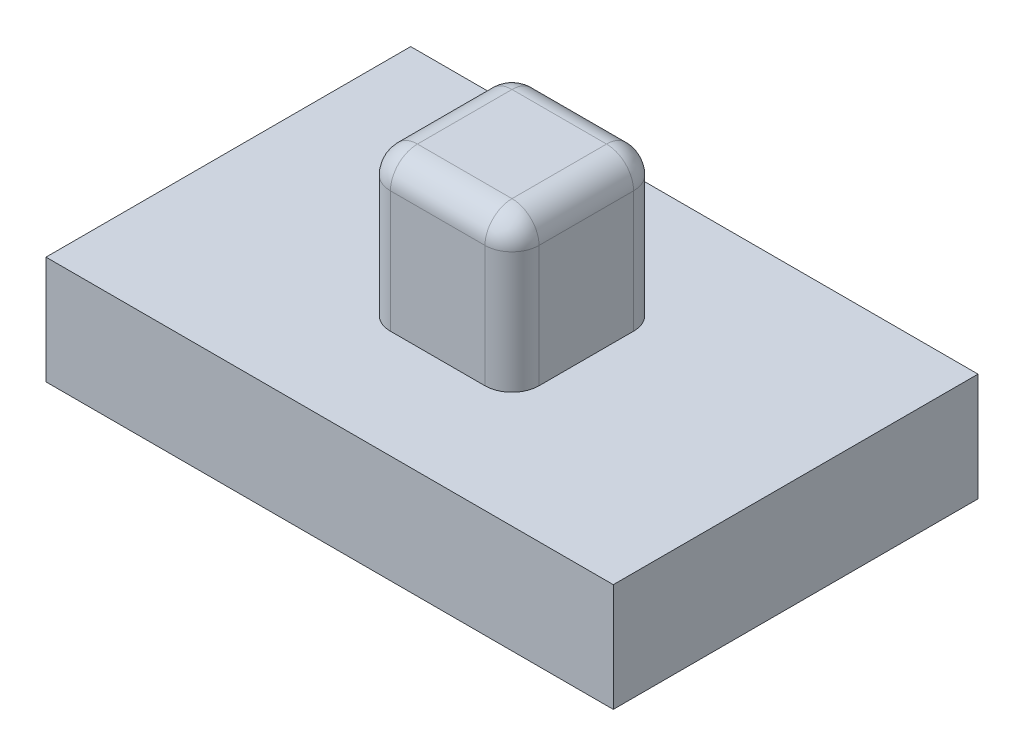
from build123d import *

# Parameters (mm, degrees)
SKETCH1_W           = 42
SKETCH1_H           = 27
BOSS_EXTRUDE1_DEPTH = 8
SKETCH2_W           = 11
SKETCH2_H           = 11
BOSS_EXTRUDE2_DEPTH = 11
FILLET1_R           = 2


with BuildPart() as part:
    # Sketch1 → Boss-Extrude1 (new body)
    with BuildSketch(Plane(origin=(0, 0, 0), x_dir=(1, 0, 0), z_dir=(0, 1, 0))):
        Rectangle(SKETCH1_W, SKETCH1_H)
    extrude(amount=BOSS_EXTRUDE1_DEPTH)

    # Sketch2 → Boss-Extrude2 (add)
    with BuildSketch(Plane(origin=(0, 8, 0), x_dir=(1, 0, 0), z_dir=(0, 1, 0))):
        Rectangle(SKETCH2_W, SKETCH2_H)
    extrude(amount=BOSS_EXTRUDE2_DEPTH)

    # Fillet1
    fillet1_edges = [part.edges().sort_by_distance(p)[0] for p in [
        (5.5, 13.5, 5.5),
        (5.5, 13.5, -5.5),
        (-5.5, 13.5, -5.5),
        (-5.5, 13.5, 5.5),
        (5.5, 19, 0),
        (0, 19, -5.5),
        (-5.5, 19, 0),
        (0, 19, 5.5),
    ]]
    fillet(fillet1_edges, radius=FILLET1_R)


solid = part.part
